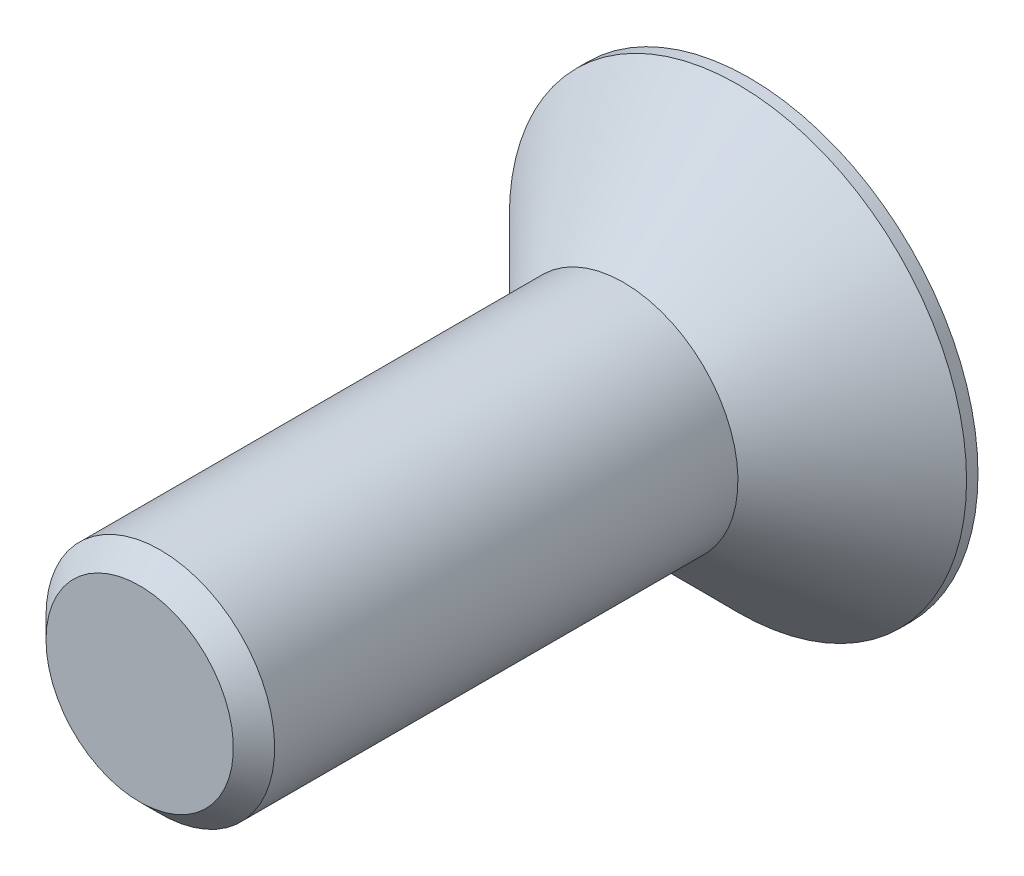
ISO-10303-21;
HEADER;
FILE_DESCRIPTION(('STEP AP214'),'2;1');
FILE_NAME('part.step','',(''),(''),'','','');
FILE_SCHEMA(('AUTOMOTIVE_DESIGN { 1 0 10303 214 1 1 1 1 }'));
ENDSEC;
DATA;
#1=APPLICATION_CONTEXT('core data for automotive mechanical design processes');
#2=APPLICATION_PROTOCOL_DEFINITION('international standard','automotive_design',2000,#1);
#3=PRODUCT_CONTEXT('',#1,'mechanical');
#4=PRODUCT('Part','Part','',(#3));
#5=PRODUCT_RELATED_PRODUCT_CATEGORY('part','',(#4));
#6=PRODUCT_DEFINITION_FORMATION('','',#4);
#7=PRODUCT_DEFINITION_CONTEXT('part definition',#1,'design');
#8=PRODUCT_DEFINITION('design','',#6,#7);
#9=PRODUCT_DEFINITION_SHAPE('','',#8);
#10=(LENGTH_UNIT() NAMED_UNIT(*) SI_UNIT(.MILLI.,.METRE.));
#11=(NAMED_UNIT(*) PLANE_ANGLE_UNIT() SI_UNIT($,.RADIAN.));
#12=(NAMED_UNIT(*) SI_UNIT($,.STERADIAN.) SOLID_ANGLE_UNIT());
#13=UNCERTAINTY_MEASURE_WITH_UNIT(LENGTH_MEASURE(1.E-05),#10,'distance_accuracy_value','');
#14=(GEOMETRIC_REPRESENTATION_CONTEXT(3) GLOBAL_UNCERTAINTY_ASSIGNED_CONTEXT((#13)) GLOBAL_UNIT_ASSIGNED_CONTEXT((#10,
#11,#12)) REPRESENTATION_CONTEXT('',''));
#15=CARTESIAN_POINT('',(0.,0.,0.));
#16=DIRECTION('',(0.,0.,1.));
#17=DIRECTION('',(1.,0.,0.));
#18=AXIS2_PLACEMENT_3D('',#15,#16,#17);
#19=CARTESIAN_POINT('',(0.,-2.45850000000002,16.));
#20=DIRECTION('',(0.,0.,-0.999999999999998));
#21=DIRECTION('',(0.,1.,0.));
#22=AXIS2_PLACEMENT_3D('',#19,#20,#21);
#23=PLANE('',#22);
#24=CARTESIAN_POINT('',(0.,0.,16.0000000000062));
#25=DIRECTION('',(0.,0.,-0.999999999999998));
#26=DIRECTION('',(-1.,0.,0.));
#27=AXIS2_PLACEMENT_3D('',#24,#25,#26);
#28=CIRCLE('',#27,2.45850000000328);
#29=CARTESIAN_POINT('',(-2.45850000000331,0.,16.0000000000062));
#30=VERTEX_POINT('',#29);
#31=EDGE_CURVE('E20',#30,#30,#28,.T.);
#32=ORIENTED_EDGE('',*,*,#31,.F.);
#33=EDGE_LOOP('',(#32));
#34=FACE_BOUND('',#33,.T.);
#35=ADVANCED_FACE('F16',(#34),#23,.F.);
#36=CARTESIAN_POINT('',(0.,0.,15.4585000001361));
#37=DIRECTION('',(0.,0.,-0.999999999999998));
#38=DIRECTION('',(-1.,0.,0.));
#39=AXIS2_PLACEMENT_3D('',#36,#37,#38);
#40=CONICAL_SURFACE('',#39,2.99999999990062,0.785398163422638);
#41=CARTESIAN_POINT('',(0.,0.,15.4585));
#42=DIRECTION('',(0.,0.,-0.999999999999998));
#43=DIRECTION('',(0.,1.,0.));
#44=AXIS2_PLACEMENT_3D('',#41,#42,#43);
#45=CIRCLE('',#44,3.);
#46=CARTESIAN_POINT('',(-3.00000000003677,0.,15.4585));
#47=VERTEX_POINT('',#46);
#48=EDGE_CURVE('E129',#47,#47,#45,.T.);
#49=CARTESIAN_POINT('',(-2.45850000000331,0.,16.0000000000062));
#50=CARTESIAN_POINT('',(-2.46414062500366,0.,15.9943593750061));
#51=CARTESIAN_POINT('',(-2.46978125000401,0.,15.988718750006));
#52=CARTESIAN_POINT('',(-2.48106250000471,0.,15.9774375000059));
#53=CARTESIAN_POINT('',(-2.48670312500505,0.,15.9717968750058));
#54=CARTESIAN_POINT('',(-2.49798437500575,0.,15.9605156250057));
#55=CARTESIAN_POINT('',(-2.5036250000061,0.,15.9548750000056));
#56=CARTESIAN_POINT('',(-2.5149062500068,0.,15.9435937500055));
#57=CARTESIAN_POINT('',(-2.52054687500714,0.,15.9379531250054));
#58=CARTESIAN_POINT('',(-2.53182812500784,0.,15.9266718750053));
#59=CARTESIAN_POINT('',(-2.53746875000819,0.,15.9210312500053));
#60=CARTESIAN_POINT('',(-2.54875000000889,0.,15.9097500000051));
#61=CARTESIAN_POINT('',(-2.55439062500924,0.,15.9041093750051));
#62=CARTESIAN_POINT('',(-2.56567187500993,0.,15.8928281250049));
#63=CARTESIAN_POINT('',(-2.57131250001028,0.,15.8871875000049));
#64=CARTESIAN_POINT('',(-2.58259375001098,0.,15.8759062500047));
#65=CARTESIAN_POINT('',(-2.58823437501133,0.,15.8702656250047));
#66=CARTESIAN_POINT('',(-2.59951562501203,0.,15.8589843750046));
#67=CARTESIAN_POINT('',(-2.60515625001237,0.,15.8533437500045));
#68=CARTESIAN_POINT('',(-2.61643750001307,0.,15.8420625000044));
#69=CARTESIAN_POINT('',(-2.62207812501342,0.,15.8364218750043));
#70=CARTESIAN_POINT('',(-2.63335937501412,0.,15.8251406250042));
#71=CARTESIAN_POINT('',(-2.63900000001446,0.,15.8195000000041));
#72=CARTESIAN_POINT('',(-2.65028125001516,0.,15.808218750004));
#73=CARTESIAN_POINT('',(-2.65592187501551,0.,15.8025781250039));
#74=CARTESIAN_POINT('',(-2.66720312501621,0.,15.7912968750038));
#75=CARTESIAN_POINT('',(-2.67284375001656,0.,15.7856562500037));
#76=CARTESIAN_POINT('',(-2.68412500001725,0.,15.7743750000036));
#77=CARTESIAN_POINT('',(-2.6897656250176,0.,15.7687343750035));
#78=CARTESIAN_POINT('',(-2.7010468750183,0.,15.7574531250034));
#79=CARTESIAN_POINT('',(-2.70668750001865,0.,15.7518125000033));
#80=CARTESIAN_POINT('',(-2.71796875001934,0.,15.7405312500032));
#81=CARTESIAN_POINT('',(-2.72360937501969,0.,15.7348906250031));
#82=CARTESIAN_POINT('',(-2.73489062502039,0.,15.723609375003));
#83=CARTESIAN_POINT('',(-2.74053125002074,0.,15.7179687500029));
#84=CARTESIAN_POINT('',(-2.75181250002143,0.,15.7066875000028));
#85=CARTESIAN_POINT('',(-2.75745312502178,0.,15.7010468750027));
#86=CARTESIAN_POINT('',(-2.76873437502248,0.,15.6897656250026));
#87=CARTESIAN_POINT('',(-2.77437500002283,0.,15.6841250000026));
#88=CARTESIAN_POINT('',(-2.78565625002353,0.,15.6728437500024));
#89=CARTESIAN_POINT('',(-2.79129687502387,0.,15.6672031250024));
#90=CARTESIAN_POINT('',(-2.80257812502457,0.,15.6559218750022));
#91=CARTESIAN_POINT('',(-2.80821875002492,0.,15.6502812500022));
#92=CARTESIAN_POINT('',(-2.81950000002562,0.,15.639000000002));
#93=CARTESIAN_POINT('',(-2.82514062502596,0.,15.633359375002));
#94=CARTESIAN_POINT('',(-2.83642187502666,0.,15.6220781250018));
#95=CARTESIAN_POINT('',(-2.84206250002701,0.,15.6164375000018));
#96=CARTESIAN_POINT('',(-2.85334375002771,0.,15.6051562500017));
#97=CARTESIAN_POINT('',(-2.85898437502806,0.,15.5995156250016));
#98=CARTESIAN_POINT('',(-2.87026562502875,0.,15.5882343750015));
#99=CARTESIAN_POINT('',(-2.8759062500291,0.,15.5825937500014));
#100=CARTESIAN_POINT('',(-2.8871875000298,0.,15.5713125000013));
#101=CARTESIAN_POINT('',(-2.89282812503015,0.,15.5656718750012));
#102=CARTESIAN_POINT('',(-2.90410937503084,0.,15.5543906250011));
#103=CARTESIAN_POINT('',(-2.90975000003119,0.,15.548750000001));
#104=CARTESIAN_POINT('',(-2.92103125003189,0.,15.5374687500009));
#105=CARTESIAN_POINT('',(-2.92667187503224,0.,15.5318281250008));
#106=CARTESIAN_POINT('',(-2.93795312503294,0.,15.5205468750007));
#107=CARTESIAN_POINT('',(-2.94359375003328,0.,15.5149062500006));
#108=CARTESIAN_POINT('',(-2.95487500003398,0.,15.5036250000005));
#109=CARTESIAN_POINT('',(-2.96051562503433,0.,15.4979843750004));
#110=CARTESIAN_POINT('',(-2.97179687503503,0.,15.4867031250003));
#111=CARTESIAN_POINT('',(-2.97743750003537,0.,15.4810625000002));
#112=CARTESIAN_POINT('',(-2.98871875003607,0.,15.4697812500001));
#113=CARTESIAN_POINT('',(-2.99435937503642,0.,15.464140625));
#114=CARTESIAN_POINT('',(-3.00000000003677,0.,15.4585));
#115=B_SPLINE_CURVE_WITH_KNOTS('',3,(#49,#50,#51,#52,#53,#54,#55,#56,#57,#58,#59,#60,#61,#62,
#63,#64,#65,#66,#67,#68,#69,#70,#71,#72,#73,#74,#75,#76,#77,#78,#79,#80,#81,#82,#83,#84,#85,#86,
#87,#88,#89,#90,#91,#92,#93,#94,#95,#96,#97,#98,#99,#100,#101,#102,#103,#104,#105,#106,#107,
#108,#109,#110,#111,#112,#113,#114),.UNSPECIFIED.,.F.,.F.,(4,2,2,2,2,2,2,2,2,2,2,2,2,2,2,2,2,2,
2,2,2,2,2,2,2,2,2,2,2,2,2,2,4),(0.,0.0239311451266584,0.0478622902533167,0.0717934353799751,
0.0957245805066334,0.119655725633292,0.14358687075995,0.167518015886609,0.191449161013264,
0.215380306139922,0.239311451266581,0.263242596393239,0.287173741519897,0.311104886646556,
0.335036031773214,0.358967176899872,0.382898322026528,0.406829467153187,0.430760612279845,
0.454691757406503,0.478622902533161,0.50255404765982,0.526485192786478,0.550416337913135,
0.574347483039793,0.59827862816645,0.622209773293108,0.646140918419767,0.670072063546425,
0.694003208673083,0.717934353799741,0.741865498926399,0.765796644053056),.UNSPECIFIED.);
#116=EDGE_CURVE('BSEAM190',#30,#47,#115,.T.);
#117=ORIENTED_EDGE('',*,*,#31,.T.);
#118=ORIENTED_EDGE('',*,*,#48,.F.);
#119=ORIENTED_EDGE('',*,*,#116,.T.);
#120=ORIENTED_EDGE('',*,*,#116,.F.);
#121=EDGE_LOOP('',(#117,#119,#118,#120));
#122=FACE_BOUND('',#121,.T.);
#123=ADVANCED_FACE('F190',(#122),#40,.T.);
#124=CARTESIAN_POINT('',(0.,0.,7.99999999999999));
#125=DIRECTION('',(0.,0.,-0.999999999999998));
#126=DIRECTION('',(0.,1.,0.));
#127=AXIS2_PLACEMENT_3D('',#124,#125,#126);
#128=CYLINDRICAL_SURFACE('',#127,3.);
#129=ORIENTED_EDGE('',*,*,#48,.T.);
#130=EDGE_LOOP('',(#129));
#131=FACE_BOUND('',#130,.T.);
#132=CARTESIAN_POINT('',(0.,0.,3.30000000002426));
#133=DIRECTION('',(0.,0.,-0.999999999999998));
#134=DIRECTION('',(-0.479425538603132,-0.877582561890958,0.));
#135=AXIS2_PLACEMENT_3D('',#132,#133,#134);
#136=CIRCLE('',#135,3.00000000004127);
#137=CARTESIAN_POINT('',(0.,3.00000000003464,3.30000000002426));
#138=VERTEX_POINT('',#137);
#139=EDGE_CURVE('E126',#138,#138,#136,.T.);
#140=ORIENTED_EDGE('',*,*,#139,.F.);
#141=EDGE_LOOP('',(#140));
#142=FACE_BOUND('',#141,.T.);
#143=ADVANCED_FACE('F186',(#131,#142),#128,.T.);
#144=CARTESIAN_POINT('',(0.,0.,0.299999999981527));
#145=DIRECTION('',(0.,0.,-0.999999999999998));
#146=DIRECTION('',(0.,1.,0.));
#147=AXIS2_PLACEMENT_3D('',#144,#145,#146);
#148=CONICAL_SURFACE('',#147,6.00000000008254,0.785398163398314);
#149=CARTESIAN_POINT('',(0.,0.,0.300000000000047));
#150=DIRECTION('',(0.,0.,-0.999999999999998));
#151=DIRECTION('',(0.,1.,0.));
#152=AXIS2_PLACEMENT_3D('',#149,#150,#151);
#153=CIRCLE('',#152,6.);
#154=CARTESIAN_POINT('',(0.,6.00000000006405,0.300000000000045));
#155=VERTEX_POINT('',#154);
#156=EDGE_CURVE('E83',#155,#155,#153,.T.);
#157=CARTESIAN_POINT('',(0.,3.00000000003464,3.30000000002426));
#158=CARTESIAN_POINT('',(0.,3.03125000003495,3.26875000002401));
#159=CARTESIAN_POINT('',(0.,3.06250000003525,3.23750000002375));
#160=CARTESIAN_POINT('',(0.,3.12500000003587,3.17500000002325));
#161=CARTESIAN_POINT('',(0.,3.15625000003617,3.143750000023));
#162=CARTESIAN_POINT('',(0.,3.21875000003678,3.08125000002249));
#163=CARTESIAN_POINT('',(0.,3.25000000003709,3.05000000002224));
#164=CARTESIAN_POINT('',(0.,3.3125000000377,2.98750000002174));
#165=CARTESIAN_POINT('',(0.,3.34375000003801,2.95625000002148));
#166=CARTESIAN_POINT('',(0.,3.40625000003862,2.89375000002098));
#167=CARTESIAN_POINT('',(0.,3.43750000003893,2.86250000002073));
#168=CARTESIAN_POINT('',(0.,3.50000000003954,2.80000000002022));
#169=CARTESIAN_POINT('',(0.,3.53125000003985,2.76875000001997));
#170=CARTESIAN_POINT('',(0.,3.59375000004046,2.70625000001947));
#171=CARTESIAN_POINT('',(0.,3.62500000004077,2.67500000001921));
#172=CARTESIAN_POINT('',(0.,3.68750000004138,2.61250000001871));
#173=CARTESIAN_POINT('',(0.,3.71875000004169,2.58125000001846));
#174=CARTESIAN_POINT('',(0.,3.7812500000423,2.51875000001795));
#175=CARTESIAN_POINT('',(0.,3.8125000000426,2.4875000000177));
#176=CARTESIAN_POINT('',(0.,3.87500000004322,2.4250000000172));
#177=CARTESIAN_POINT('',(0.,3.90625000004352,2.39375000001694));
#178=CARTESIAN_POINT('',(0.,3.96875000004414,2.33125000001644));
#179=CARTESIAN_POINT('',(0.,4.00000000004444,2.30000000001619));
#180=CARTESIAN_POINT('',(0.,4.06250000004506,2.23750000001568));
#181=CARTESIAN_POINT('',(0.,4.09375000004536,2.20625000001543));
#182=CARTESIAN_POINT('',(0.,4.15625000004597,2.14375000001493));
#183=CARTESIAN_POINT('',(0.,4.18750000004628,2.11250000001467));
#184=CARTESIAN_POINT('',(0.,4.25000000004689,2.05000000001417));
#185=CARTESIAN_POINT('',(0.,4.2812500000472,2.01875000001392));
#186=CARTESIAN_POINT('',(0.,4.34375000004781,1.95625000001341));
#187=CARTESIAN_POINT('',(0.,4.37500000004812,1.92500000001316));
#188=CARTESIAN_POINT('',(0.,4.43750000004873,1.86250000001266));
#189=CARTESIAN_POINT('',(0.,4.46875000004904,1.8312500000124));
#190=CARTESIAN_POINT('',(0.,4.53125000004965,1.7687500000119));
#191=CARTESIAN_POINT('',(0.,4.56250000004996,1.73750000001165));
#192=CARTESIAN_POINT('',(0.,4.62500000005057,1.67500000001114));
#193=CARTESIAN_POINT('',(0.,4.65625000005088,1.64375000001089));
#194=CARTESIAN_POINT('',(0.,4.71875000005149,1.58125000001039));
#195=CARTESIAN_POINT('',(0.,4.7500000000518,1.55000000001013));
#196=CARTESIAN_POINT('',(0.,4.81250000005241,1.48750000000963));
#197=CARTESIAN_POINT('',(0.,4.84375000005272,1.45625000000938));
#198=CARTESIAN_POINT('',(0.,4.90625000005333,1.39375000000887));
#199=CARTESIAN_POINT('',(0.,4.93750000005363,1.36250000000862));
#200=CARTESIAN_POINT('',(0.,5.00000000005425,1.30000000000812));
#201=CARTESIAN_POINT('',(0.,5.03125000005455,1.26875000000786));
#202=CARTESIAN_POINT('',(0.,5.09375000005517,1.20625000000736));
#203=CARTESIAN_POINT('',(0.,5.12500000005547,1.17500000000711));
#204=CARTESIAN_POINT('',(0.,5.18750000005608,1.1125000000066));
#205=CARTESIAN_POINT('',(0.,5.21875000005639,1.08125000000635));
#206=CARTESIAN_POINT('',(0.,5.281250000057,1.01875000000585));
#207=CARTESIAN_POINT('',(0.,5.31250000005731,0.987500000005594));
#208=CARTESIAN_POINT('',(0.,5.37500000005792,0.92500000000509));
#209=CARTESIAN_POINT('',(0.,5.40625000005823,0.893750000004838));
#210=CARTESIAN_POINT('',(0.,5.46875000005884,0.831250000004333));
#211=CARTESIAN_POINT('',(0.,5.50000000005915,0.800000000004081));
#212=CARTESIAN_POINT('',(0.,5.56250000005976,0.737500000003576));
#213=CARTESIAN_POINT('',(0.,5.59375000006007,0.706250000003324));
#214=CARTESIAN_POINT('',(0.,5.65625000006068,0.64375000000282));
#215=CARTESIAN_POINT('',(0.,5.68750000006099,0.612500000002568));
#216=CARTESIAN_POINT('',(0.,5.7500000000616,0.550000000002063));
#217=CARTESIAN_POINT('',(0.,5.78125000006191,0.518750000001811));
#218=CARTESIAN_POINT('',(0.,5.84375000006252,0.456250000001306));
#219=CARTESIAN_POINT('',(0.,5.87500000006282,0.425000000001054));
#220=CARTESIAN_POINT('',(0.,5.93750000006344,0.36250000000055));
#221=CARTESIAN_POINT('',(0.,5.96875000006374,0.331250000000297));
#222=CARTESIAN_POINT('',(0.,6.00000000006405,0.300000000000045));
#223=B_SPLINE_CURVE_WITH_KNOTS('',3,(#157,#158,#159,#160,#161,#162,#163,#164,#165,#166,#167,
#168,#169,#170,#171,#172,#173,#174,#175,#176,#177,#178,#179,#180,#181,#182,#183,#184,#185,#186,
#187,#188,#189,#190,#191,#192,#193,#194,#195,#196,#197,#198,#199,#200,#201,#202,#203,#204,#205,
#206,#207,#208,#209,#210,#211,#212,#213,#214,#215,#216,#217,#218,#219,#220,#221,#222),
.UNSPECIFIED.,.F.,.F.,(4,2,2,2,2,2,2,2,2,2,2,2,2,2,2,2,2,2,2,2,2,2,2,2,2,2,2,2,2,2,2,2,4),(0.,
0.132582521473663,0.265165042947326,0.397747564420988,0.530330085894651,0.662912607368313,
0.795495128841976,0.928077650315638,1.0606601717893,1.19324269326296,1.32582521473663,
1.45840773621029,1.59099025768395,1.72357277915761,1.85615530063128,1.98873782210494,
2.1213203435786,2.25390286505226,2.38648538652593,2.51906790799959,2.65165042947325,
2.78423295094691,2.91681547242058,3.04939799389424,3.1819805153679,3.31456303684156,
3.44714555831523,3.57972807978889,3.71231060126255,3.84489312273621,3.97747564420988,
4.11005816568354,4.2426406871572),.UNSPECIFIED.);
#224=EDGE_CURVE('BSEAM145',#138,#155,#223,.T.);
#225=ORIENTED_EDGE('',*,*,#139,.T.);
#226=ORIENTED_EDGE('',*,*,#156,.F.);
#227=ORIENTED_EDGE('',*,*,#224,.T.);
#228=ORIENTED_EDGE('',*,*,#224,.F.);
#229=EDGE_LOOP('',(#225,#227,#226,#228));
#230=FACE_BOUND('',#229,.T.);
#231=ADVANCED_FACE('F145',(#230),#148,.T.);
#232=CARTESIAN_POINT('',(0.,0.,2.79999999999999));
#233=DIRECTION('',(0.,0.,-0.999999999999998));
#234=DIRECTION('',(0.,1.,0.));
#235=AXIS2_PLACEMENT_3D('',#232,#233,#234);
#236=PLANE('',#235);
#237=DIRECTION('',(0.500000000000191,-0.86602540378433,0.));
#238=VECTOR('',#237,1.);
#239=CARTESIAN_POINT('',(1.15470053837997,2.00000000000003,2.80000000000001));
#240=LINE('',#239,#238);
#241=CARTESIAN_POINT('',(2.30940107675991,0.,2.79999999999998));
#242=VERTEX_POINT('',#241);
#243=CARTESIAN_POINT('',(1.15470053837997,2.00000000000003,2.80000000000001));
#244=VERTEX_POINT('',#243);
#245=EDGE_CURVE('E74',#242,#244,#240,.F.);
#246=ORIENTED_EDGE('',*,*,#245,.F.);
#247=DIRECTION('',(-0.50000000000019,-0.866025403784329,0.));
#248=VECTOR('',#247,1.);
#249=CARTESIAN_POINT('',(2.30940107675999,0.,2.79999999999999));
#250=LINE('',#249,#248);
#251=CARTESIAN_POINT('',(1.15470053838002,-1.99999999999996,2.80000000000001));
#252=VERTEX_POINT('',#251);
#253=EDGE_CURVE('E109',#252,#242,#250,.F.);
#254=ORIENTED_EDGE('',*,*,#253,.F.);
#255=DIRECTION('',(1.,0.,0.));
#256=VECTOR('',#255,1.);
#257=CARTESIAN_POINT('',(1.15470053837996,-1.99999999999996,2.80000000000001));
#258=LINE('',#257,#256);
#259=CARTESIAN_POINT('',(-1.15470053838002,-1.99999999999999,2.80000000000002));
#260=VERTEX_POINT('',#259);
#261=EDGE_CURVE('E59',#260,#252,#258,.T.);
#262=ORIENTED_EDGE('',*,*,#261,.F.);
#263=DIRECTION('',(-0.500000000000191,0.86602540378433,0.));
#264=VECTOR('',#263,1.);
#265=CARTESIAN_POINT('',(-1.15470053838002,-1.99999999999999,2.80000000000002));
#266=LINE('',#265,#264);
#267=CARTESIAN_POINT('',(-2.30940107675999,0.,2.79999999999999));
#268=VERTEX_POINT('',#267);
#269=EDGE_CURVE('E102',#268,#260,#266,.F.);
#270=ORIENTED_EDGE('',*,*,#269,.F.);
#271=DIRECTION('',(0.50000000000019,0.866025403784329,0.));
#272=VECTOR('',#271,1.);
#273=CARTESIAN_POINT('',(-2.30940107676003,0.,2.8));
#274=LINE('',#273,#272);
#275=CARTESIAN_POINT('',(-1.15470053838,1.99999999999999,2.8));
#276=VERTEX_POINT('',#275);
#277=EDGE_CURVE('E89',#276,#268,#274,.F.);
#278=ORIENTED_EDGE('',*,*,#277,.F.);
#279=DIRECTION('',(1.,0.,0.));
#280=VECTOR('',#279,1.);
#281=CARTESIAN_POINT('',(-1.15470053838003,1.99999999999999,2.79999999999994));
#282=LINE('',#281,#280);
#283=EDGE_CURVE('E86',#244,#276,#282,.F.);
#284=ORIENTED_EDGE('',*,*,#283,.F.);
#285=EDGE_LOOP('',(#246,#254,#262,#270,#278,#284));
#286=FACE_BOUND('',#285,.T.);
#287=ADVANCED_FACE('F87',(#286),#236,.T.);
#288=CARTESIAN_POINT('',(0.,0.,7.99999999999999));
#289=DIRECTION('',(0.,0.,-0.999999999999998));
#290=DIRECTION('',(0.,1.,0.));
#291=AXIS2_PLACEMENT_3D('',#288,#289,#290);
#292=CYLINDRICAL_SURFACE('',#291,6.);
#293=CARTESIAN_POINT('',(0.,0.,0.));
#294=DIRECTION('',(0.,0.,-0.999999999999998));
#295=DIRECTION('',(0.,1.,0.));
#296=AXIS2_PLACEMENT_3D('',#293,#294,#295);
#297=CIRCLE('',#296,6.);
#298=CARTESIAN_POINT('',(0.,6.,0.));
#299=VERTEX_POINT('',#298);
#300=EDGE_CURVE('E111',#299,#299,#297,.T.);
#301=CARTESIAN_POINT('',(0.,6.,0.300000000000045));
#302=CARTESIAN_POINT('',(0.,6.,0.296875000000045));
#303=CARTESIAN_POINT('',(0.,6.,0.293750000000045));
#304=CARTESIAN_POINT('',(0.,6.,0.287500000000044));
#305=CARTESIAN_POINT('',(0.,6.,0.284375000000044));
#306=CARTESIAN_POINT('',(0.,6.,0.278125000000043));
#307=CARTESIAN_POINT('',(0.,6.,0.275000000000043));
#308=CARTESIAN_POINT('',(0.,6.,0.268750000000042));
#309=CARTESIAN_POINT('',(0.,6.,0.265625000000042));
#310=CARTESIAN_POINT('',(0.,6.,0.259375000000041));
#311=CARTESIAN_POINT('',(0.,6.,0.256250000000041));
#312=CARTESIAN_POINT('',(0.,6.,0.25000000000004));
#313=CARTESIAN_POINT('',(0.,6.,0.24687500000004));
#314=CARTESIAN_POINT('',(0.,6.,0.24062500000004));
#315=CARTESIAN_POINT('',(0.,6.,0.237500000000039));
#316=CARTESIAN_POINT('',(0.,6.,0.231250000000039));
#317=CARTESIAN_POINT('',(0.,6.,0.228125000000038));
#318=CARTESIAN_POINT('',(0.,6.,0.221875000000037));
#319=CARTESIAN_POINT('',(0.,6.,0.218750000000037));
#320=CARTESIAN_POINT('',(0.,6.,0.212500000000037));
#321=CARTESIAN_POINT('',(0.,6.,0.209375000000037));
#322=CARTESIAN_POINT('',(0.,6.,0.203125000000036));
#323=CARTESIAN_POINT('',(0.,6.,0.200000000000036));
#324=CARTESIAN_POINT('',(0.,6.,0.193750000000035));
#325=CARTESIAN_POINT('',(0.,6.,0.190625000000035));
#326=CARTESIAN_POINT('',(0.,6.,0.184375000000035));
#327=CARTESIAN_POINT('',(0.,6.,0.181250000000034));
#328=CARTESIAN_POINT('',(0.,6.,0.175000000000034));
#329=CARTESIAN_POINT('',(0.,6.,0.171875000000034));
#330=CARTESIAN_POINT('',(0.,6.,0.165625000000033));
#331=CARTESIAN_POINT('',(0.,6.,0.162500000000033));
#332=CARTESIAN_POINT('',(0.,6.,0.156250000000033));
#333=CARTESIAN_POINT('',(0.,6.,0.153125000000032));
#334=CARTESIAN_POINT('',(0.,6.,0.146875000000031));
#335=CARTESIAN_POINT('',(0.,6.,0.14375000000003));
#336=CARTESIAN_POINT('',(0.,6.,0.137500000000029));
#337=CARTESIAN_POINT('',(0.,6.,0.134375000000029));
#338=CARTESIAN_POINT('',(0.,6.,0.128125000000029));
#339=CARTESIAN_POINT('',(0.,6.,0.125000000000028));
#340=CARTESIAN_POINT('',(0.,6.,0.118750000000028));
#341=CARTESIAN_POINT('',(0.,6.,0.115625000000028));
#342=CARTESIAN_POINT('',(0.,6.,0.109375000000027));
#343=CARTESIAN_POINT('',(0.,6.,0.106250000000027));
#344=CARTESIAN_POINT('',(0.,6.,0.100000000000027));
#345=CARTESIAN_POINT('',(0.,6.,0.0968750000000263));
#346=CARTESIAN_POINT('',(0.,6.,0.0906250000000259));
#347=CARTESIAN_POINT('',(0.,6.,0.0875000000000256));
#348=CARTESIAN_POINT('',(0.,6.,0.0812500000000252));
#349=CARTESIAN_POINT('',(0.,6.,0.0781250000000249));
#350=CARTESIAN_POINT('',(0.,6.,0.0718750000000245));
#351=CARTESIAN_POINT('',(0.,6.,0.0687500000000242));
#352=CARTESIAN_POINT('',(0.,6.,0.0625000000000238));
#353=CARTESIAN_POINT('',(0.,6.,0.0593750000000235));
#354=CARTESIAN_POINT('',(0.,6.,0.0531250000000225));
#355=CARTESIAN_POINT('',(0.,6.,0.0500000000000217));
#356=CARTESIAN_POINT('',(0.,6.,0.0437500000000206));
#357=CARTESIAN_POINT('',(0.,6.,0.0406250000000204));
#358=CARTESIAN_POINT('',(0.,6.,0.0343750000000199));
#359=CARTESIAN_POINT('',(0.,6.,0.0312500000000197));
#360=CARTESIAN_POINT('',(0.,6.,0.0250000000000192));
#361=CARTESIAN_POINT('',(0.,6.,0.021875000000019));
#362=CARTESIAN_POINT('',(0.,6.,0.0156250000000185));
#363=CARTESIAN_POINT('',(0.,6.,0.0125000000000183));
#364=CARTESIAN_POINT('',(0.,6.,0.00625000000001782));
#365=CARTESIAN_POINT('',(0.,6.,0.00312500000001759));
#366=CARTESIAN_POINT('',(0.,6.,0.));
#367=B_SPLINE_CURVE_WITH_KNOTS('',3,(#301,#302,#303,#304,#305,#306,#307,#308,#309,#310,#311,
#312,#313,#314,#315,#316,#317,#318,#319,#320,#321,#322,#323,#324,#325,#326,#327,#328,#329,#330,
#331,#332,#333,#334,#335,#336,#337,#338,#339,#340,#341,#342,#343,#344,#345,#346,#347,#348,#349,
#350,#351,#352,#353,#354,#355,#356,#357,#358,#359,#360,#361,#362,#363,#364,#365,#366),
.UNSPECIFIED.,.F.,.F.,(4,2,2,2,2,2,2,2,2,2,2,2,2,2,2,2,2,2,2,2,2,2,2,2,2,2,2,2,2,2,2,2,4),(0.,
0.0093750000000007,0.0187500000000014,0.028125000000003,0.0375000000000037,0.0468750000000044,
0.0562500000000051,0.0656250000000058,0.0750000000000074,0.0843750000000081,0.0937500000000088,
0.103125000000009,0.11250000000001,0.121875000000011,0.131250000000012,0.140625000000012,
0.150000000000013,0.159375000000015,0.168750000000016,0.178125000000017,0.187500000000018,
0.196875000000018,0.206250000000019,0.21562500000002,0.22500000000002,0.234375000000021,
0.243750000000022,0.253125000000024,0.262500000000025,0.271875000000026,0.281250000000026,
0.290625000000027,0.300000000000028),.UNSPECIFIED.);
#368=EDGE_CURVE('BSEAM135',#155,#299,#367,.T.);
#369=ORIENTED_EDGE('',*,*,#156,.T.);
#370=ORIENTED_EDGE('',*,*,#300,.F.);
#371=ORIENTED_EDGE('',*,*,#368,.T.);
#372=ORIENTED_EDGE('',*,*,#368,.F.);
#373=EDGE_LOOP('',(#369,#371,#370,#372));
#374=FACE_BOUND('',#373,.T.);
#375=ADVANCED_FACE('F135',(#374),#292,.T.);
#376=CARTESIAN_POINT('',(1.1547005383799,2.00000000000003,0.));
#377=DIRECTION('',(-0.866025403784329,-0.50000000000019,0.));
#378=DIRECTION('',(0.500000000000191,-0.86602540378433,0.));
#379=AXIS2_PLACEMENT_3D('',#376,#377,#378);
#380=PLANE('',#379);
#381=DIRECTION('',(0.,0.,0.999999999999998));
#382=VECTOR('',#381,1.);
#383=CARTESIAN_POINT('',(2.30940107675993,0.,0.));
#384=LINE('',#383,#382);
#385=CARTESIAN_POINT('',(2.30940107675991,0.,0.));
#386=VERTEX_POINT('',#385);
#387=EDGE_CURVE('E80',#242,#386,#384,.F.);
#388=ORIENTED_EDGE('',*,*,#387,.F.);
#389=ORIENTED_EDGE('',*,*,#245,.T.);
#390=DIRECTION('',(0.,0.,-0.999999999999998));
#391=VECTOR('',#390,1.);
#392=CARTESIAN_POINT('',(1.1547005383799,2.00000000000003,0.));
#393=LINE('',#392,#391);
#394=CARTESIAN_POINT('',(1.1547005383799,2.00000000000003,0.));
#395=VERTEX_POINT('',#394);
#396=EDGE_CURVE('E78',#395,#244,#393,.F.);
#397=ORIENTED_EDGE('',*,*,#396,.F.);
#398=DIRECTION('',(-0.500000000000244,0.8660254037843,0.));
#399=VECTOR('',#398,1.);
#400=CARTESIAN_POINT('',(2.30940107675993,0.,0.));
#401=LINE('',#400,#399);
#402=EDGE_CURVE('E55',#386,#395,#401,.T.);
#403=ORIENTED_EDGE('',*,*,#402,.F.);
#404=EDGE_LOOP('',(#388,#389,#397,#403));
#405=FACE_BOUND('',#404,.T.);
#406=ADVANCED_FACE('F76',(#405),#380,.T.);
#407=CARTESIAN_POINT('',(-1.15470053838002,2.00000000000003,0.));
#408=DIRECTION('',(0.,-1.,0.));
#409=DIRECTION('',(0.,0.,-0.999999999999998));
#410=AXIS2_PLACEMENT_3D('',#407,#408,#409);
#411=PLANE('',#410);
#412=ORIENTED_EDGE('',*,*,#396,.T.);
#413=ORIENTED_EDGE('',*,*,#283,.T.);
#414=DIRECTION('',(0.,0.,0.999999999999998));
#415=VECTOR('',#414,1.);
#416=CARTESIAN_POINT('',(-1.15470053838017,2.0000000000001,0.));
#417=LINE('',#416,#415);
#418=CARTESIAN_POINT('',(-1.15470053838,1.99999999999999,0.));
#419=VERTEX_POINT('',#418);
#420=EDGE_CURVE('E92',#419,#276,#417,.T.);
#421=ORIENTED_EDGE('',*,*,#420,.F.);
#422=DIRECTION('',(1.,0.,0.));
#423=VECTOR('',#422,1.);
#424=CARTESIAN_POINT('',(0.,2.00000000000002,0.));
#425=LINE('',#424,#423);
#426=EDGE_CURVE('E96',#395,#419,#425,.F.);
#427=ORIENTED_EDGE('',*,*,#426,.F.);
#428=EDGE_LOOP('',(#412,#413,#421,#427));
#429=FACE_BOUND('',#428,.T.);
#430=ADVANCED_FACE('F94',(#429),#411,.T.);
#431=CARTESIAN_POINT('',(-2.30940107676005,0.,0.));
#432=DIRECTION('',(0.86602540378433,-0.500000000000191,0.));
#433=DIRECTION('',(0.50000000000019,0.866025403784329,0.));
#434=AXIS2_PLACEMENT_3D('',#431,#432,#433);
#435=PLANE('',#434);
#436=ORIENTED_EDGE('',*,*,#420,.T.);
#437=ORIENTED_EDGE('',*,*,#277,.T.);
#438=DIRECTION('',(0.,0.,0.999999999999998));
#439=VECTOR('',#438,1.);
#440=CARTESIAN_POINT('',(-2.30940107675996,1.11022302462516E-13,0.));
#441=LINE('',#440,#439);
#442=CARTESIAN_POINT('',(-2.30940107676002,0.,0.));
#443=VERTEX_POINT('',#442);
#444=EDGE_CURVE('E100',#443,#268,#441,.T.);
#445=ORIENTED_EDGE('',*,*,#444,.F.);
#446=DIRECTION('',(-0.500000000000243,-0.866025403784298,0.));
#447=VECTOR('',#446,1.);
#448=CARTESIAN_POINT('',(-1.15470053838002,2.00000000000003,0.));
#449=LINE('',#448,#447);
#450=EDGE_CURVE('E119',#419,#443,#449,.T.);
#451=ORIENTED_EDGE('',*,*,#450,.F.);
#452=EDGE_LOOP('',(#436,#437,#445,#451));
#453=FACE_BOUND('',#452,.T.);
#454=ADVANCED_FACE('F160',(#453),#435,.T.);
#455=CARTESIAN_POINT('',(-1.15470053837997,-2.00000000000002,0.));
#456=DIRECTION('',(0.866025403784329,0.50000000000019,0.));
#457=DIRECTION('',(-0.500000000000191,0.86602540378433,0.));
#458=AXIS2_PLACEMENT_3D('',#455,#456,#457);
#459=PLANE('',#458);
#460=ORIENTED_EDGE('',*,*,#444,.T.);
#461=ORIENTED_EDGE('',*,*,#269,.T.);
#462=DIRECTION('',(0.,0.,0.999999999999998));
#463=VECTOR('',#462,1.);
#464=CARTESIAN_POINT('',(-1.15470053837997,-2.00000000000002,0.));
#465=LINE('',#464,#463);
#466=CARTESIAN_POINT('',(-1.15470053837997,-2.00000000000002,0.));
#467=VERTEX_POINT('',#466);
#468=EDGE_CURVE('E104',#467,#260,#465,.T.);
#469=ORIENTED_EDGE('',*,*,#468,.F.);
#470=DIRECTION('',(0.500000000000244,-0.8660254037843,0.));
#471=VECTOR('',#470,1.);
#472=CARTESIAN_POINT('',(-2.30940107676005,0.,0.));
#473=LINE('',#472,#471);
#474=EDGE_CURVE('E116',#443,#467,#473,.T.);
#475=ORIENTED_EDGE('',*,*,#474,.F.);
#476=EDGE_LOOP('',(#460,#461,#469,#475));
#477=FACE_BOUND('',#476,.T.);
#478=ADVANCED_FACE('F157',(#477),#459,.T.);
#479=CARTESIAN_POINT('',(1.15470053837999,-1.99999999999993,0.));
#480=DIRECTION('',(0.,1.,0.));
#481=DIRECTION('',(0.,0.,0.999999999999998));
#482=AXIS2_PLACEMENT_3D('',#479,#480,#481);
#483=PLANE('',#482);
#484=ORIENTED_EDGE('',*,*,#468,.T.);
#485=ORIENTED_EDGE('',*,*,#261,.T.);
#486=DIRECTION('',(0.,0.,0.999999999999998));
#487=VECTOR('',#486,1.);
#488=CARTESIAN_POINT('',(1.15470053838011,-2.00000000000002,0.));
#489=LINE('',#488,#487);
#490=CARTESIAN_POINT('',(1.15470053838,-1.99999999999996,0.));
#491=VERTEX_POINT('',#490);
#492=EDGE_CURVE('E35',#491,#252,#489,.T.);
#493=ORIENTED_EDGE('',*,*,#492,.F.);
#494=DIRECTION('',(1.,0.,0.));
#495=VECTOR('',#494,1.);
#496=CARTESIAN_POINT('',(0.,-2.00000000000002,0.));
#497=LINE('',#496,#495);
#498=EDGE_CURVE('E26',#467,#491,#497,.T.);
#499=ORIENTED_EDGE('',*,*,#498,.F.);
#500=EDGE_LOOP('',(#484,#485,#493,#499));
#501=FACE_BOUND('',#500,.T.);
#502=ADVANCED_FACE('F153',(#501),#483,.T.);
#503=CARTESIAN_POINT('',(2.30940107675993,0.,0.));
#504=DIRECTION('',(-0.86602540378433,0.500000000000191,0.));
#505=DIRECTION('',(-0.50000000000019,-0.866025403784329,0.));
#506=AXIS2_PLACEMENT_3D('',#503,#504,#505);
#507=PLANE('',#506);
#508=ORIENTED_EDGE('',*,*,#492,.T.);
#509=ORIENTED_EDGE('',*,*,#253,.T.);
#510=ORIENTED_EDGE('',*,*,#387,.T.);
#511=DIRECTION('',(0.500000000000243,0.866025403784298,0.));
#512=VECTOR('',#511,1.);
#513=CARTESIAN_POINT('',(1.15470053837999,-1.99999999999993,0.));
#514=LINE('',#513,#512);
#515=EDGE_CURVE('E11',#491,#386,#514,.T.);
#516=ORIENTED_EDGE('',*,*,#515,.F.);
#517=EDGE_LOOP('',(#508,#509,#510,#516));
#518=FACE_BOUND('',#517,.T.);
#519=ADVANCED_FACE('F148',(#518),#507,.T.);
#520=CARTESIAN_POINT('',(0.,0.,0.));
#521=DIRECTION('',(0.,0.,-0.999999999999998));
#522=DIRECTION('',(0.,1.,0.));
#523=AXIS2_PLACEMENT_3D('',#520,#521,#522);
#524=PLANE('',#523);
#525=ORIENTED_EDGE('',*,*,#498,.T.);
#526=ORIENTED_EDGE('',*,*,#515,.T.);
#527=ORIENTED_EDGE('',*,*,#402,.T.);
#528=ORIENTED_EDGE('',*,*,#426,.T.);
#529=ORIENTED_EDGE('',*,*,#450,.T.);
#530=ORIENTED_EDGE('',*,*,#474,.T.);
#531=EDGE_LOOP('',(#525,#526,#527,#528,#529,#530));
#532=FACE_BOUND('',#531,.T.);
#533=ORIENTED_EDGE('',*,*,#300,.T.);
#534=EDGE_LOOP('',(#533));
#535=FACE_BOUND('',#534,.T.);
#536=ADVANCED_FACE('F18',(#532,#535),#524,.T.);
#537=CLOSED_SHELL('',(#35,#123,#143,#231,#287,#375,#406,#430,#454,#478,#502,#519,#536));
#538=MANIFOLD_SOLID_BREP('B1',#537);
#539=ADVANCED_BREP_SHAPE_REPRESENTATION('',(#18,#538),#14);
#540=SHAPE_DEFINITION_REPRESENTATION(#9,#539);
ENDSEC;
END-ISO-10303-21;
